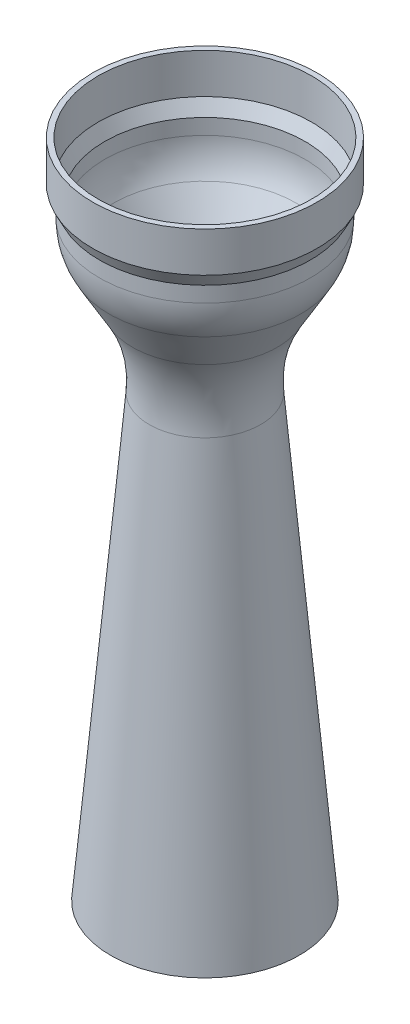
from build123d import *


with BuildPart() as part:
    # Sketch5 → Revolve1 (revolve)
    with BuildSketch(Plane.XY, mode=Mode.PRIVATE) as revolve1_sk:
        with BuildLine():
            Line((10.608388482, -31.822893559), (17.937957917, -115.600255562))
            Line((17.937957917, -115.600255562), (16.918076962, -115.600255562))
            Line((16.918076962, -115.600255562), (9.596254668, -31.911443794))
            ThreePointArc((9.596254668, -31.911443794), (10.101681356, -24.200122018), (12.902554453, -16.997688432))
            Line((12.902554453, -16.997688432), (17.348522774, -9.297045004))
            ThreePointArc((17.348522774, -9.297045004), (18.617258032, -6.234046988), (19.05, -2.947045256))
            Line((19.05, -2.947045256), (19.05, 1.56e-07))
            Line((19.05, 1.56e-07), (20.32, 2.540000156))
            Line((20.32, 2.540000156), (20.32, 10.160000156))
            Line((20.32, 10.160000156), (21.336, 10.160000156))
            Line((21.336, 10.160000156), (21.336, 2.54))
            Line((21.336, 2.54), (20.066, 0))
            Line((20.066, 0), (20.066, -2.947045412))
            ThreePointArc((20.066, -2.947045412), (19.598638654, -6.497007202), (18.228404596, -9.805044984))
            Line((18.228404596, -9.805044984), (13.782436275, -17.505688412))
            ThreePointArc((13.782436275, -17.505688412), (11.093598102, -24.420024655), (10.608388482, -31.822893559))
        make_face()
    revolve(revolve1_sk.sketch.rotate(Axis((0, 0, 0), (0, -1, 0)), 180), axis=Axis((0, 0, 0), (0, -1, 0)))


solid = part.part
